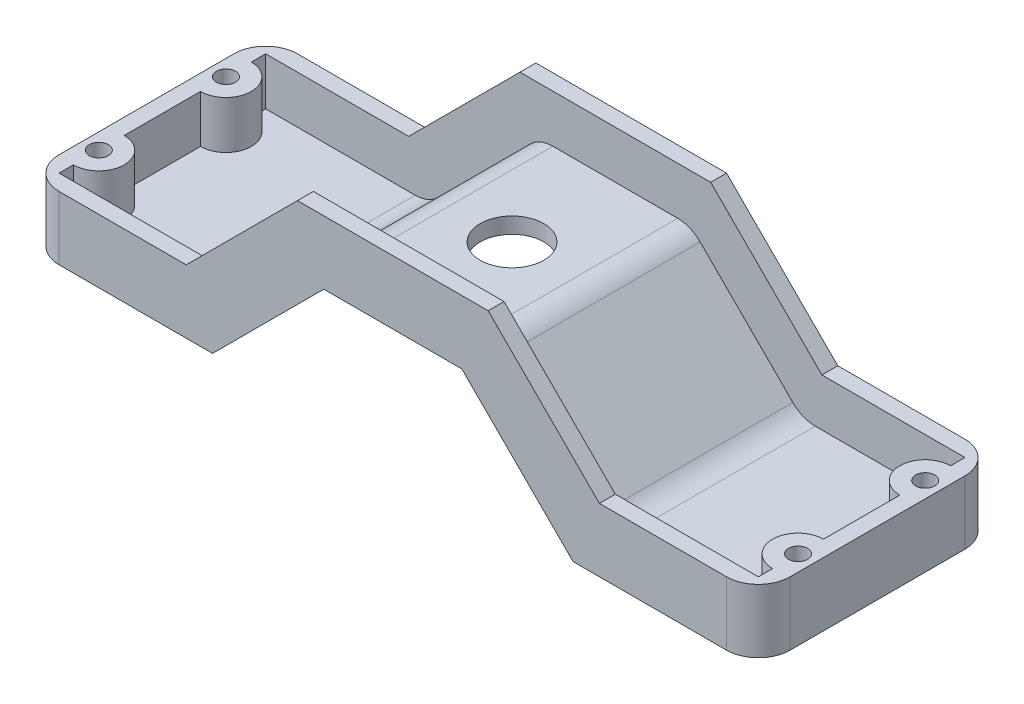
from build123d import *

# Parameters (mm, degrees)
EXTRUDE_THIN1_DEPTH     = 37.5
SHELL1_T                = -5
FILLET1_R               = 10
FILLET2_R               = 10
BOSS_EXTRUDE3_REACH     = 237.651
SKETCH5_R               = 3
CUT_EXTRUDE2_DEPTH      = 236.650694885
MIRROR3_COPY_1_REACH    = 237.651
MIRROR3_COPY_2_SKETCH_R = 3
MIRROR3_COPY_2_DEPTH    = 236.650694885
SKETCH7_R               = 10
CUT_EXTRUDE4_DEPTH      = 236.650694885


with BuildPart() as part:
    # Sketch1 → Extrude-Thin1 (new, symmetric)
    with BuildSketch(Plane.XY):
        Polygon((0, 0), (50, 0), (85, 35), (145, 35), (180, 0), (230, 0), (230, -20), (171.715728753, -20), (136.715728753, 15), (93.284271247, 15), (58.284271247, -20), (0, -20), align=None)
    extrude(amount=EXTRUDE_THIN1_DEPTH, both=True)

    # Shell1
    shell1_openings = [part.faces().sort_by_distance(p)[0] for p in [
        (25, 0, 0),
        (67.5, 17.5, 0),
        (115, 35, 0),
        (162.5, 17.5, 0),
        (205, 0, 0),
    ]]
    offset(amount=SHELL1_T, openings=shell1_openings, kind=Kind.INTERSECTION)

    # Fillet1
    fillet1_edges = [part.edges().sort_by_distance(p)[0] for p in [
        (0, -10, -37.5),
        (230, -10, -37.5),
        (0, -10, 37.5),
        (230, -10, 37.5),
    ]]
    fillet(fillet1_edges, radius=FILLET1_R)

    # Fillet2
    fillet2_edges = [part.edges().sort_by_distance(p)[0] for p in [
        (173.786796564, -15, 0),
        (56.213203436, -15, 0),
        (91.213203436, 20, 0),
        (138.786796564, 20, 0),
    ]]
    fillet(fillet2_edges, radius=FILLET2_R)

    # Sketch4 → Boss-Extrude3 (add, up to next)
    with BuildSketch(Plane(origin=(0, 0, 0), x_dir=(1, 0, 0), z_dir=(0, 1, 0)), mode=Mode.PRIVATE) as boss_extrude3_sk1:
        with BuildLine():
            Line((5, 28), (5, 12))
            ThreePointArc((5, 12), (13, 20), (5, 28))
        make_face()
    boss_extrude3_tool1 = extrude(boss_extrude3_sk1.sketch, amount=-BOSS_EXTRUDE3_REACH, mode=Mode.PRIVATE) - part.part
    boss_extrude3 = boss_extrude3_tool1.solids().sort_by_distance((8.395305, 0, -20))[0]
    add(boss_extrude3)

    # Sketch5 → Cut-Extrude2 (cut, through all)
    with BuildSketch(Plane(origin=(0, 0, 0), x_dir=(1, 0, 0), z_dir=(0, 1, 0))):
        with Locations(Location((5, 20, 0), (0, 0, 270))):
            Circle(SKETCH5_R)
    cut_extrude2 = extrude(amount=-CUT_EXTRUDE2_DEPTH, mode=Mode.SUBTRACT)

    # Mirror2: Boss-Extrude3, Cut-Extrude2 across plane
    add(boss_extrude3.mirror(Plane.XY))
    add(cut_extrude2.mirror(Plane.XY), mode=Mode.SUBTRACT)

    # Mirror3: Boss-Extrude3, Cut-Extrude2 across plane
    add(boss_extrude3.mirror(Plane.ZY.offset(-115)))
    add(cut_extrude2.mirror(Plane.ZY.offset(-115)), mode=Mode.SUBTRACT)

    # Mirror3 copy 1 sketch → Mirror3 copy 1 (add, up to next)
    with BuildSketch(Plane(origin=(230, 0, 0), x_dir=(-1, 0, 0), z_dir=(0, 1, 0)), mode=Mode.PRIVATE) as mirror3_copy_1_sk1:
        with BuildLine():
            Line((5, 28), (5, 12))
            ThreePointArc((5, 12), (13, 20), (5, 28))
        make_face()
    mirror3_copy_1_tool1 = extrude(mirror3_copy_1_sk1.sketch, amount=-MIRROR3_COPY_1_REACH, mode=Mode.PRIVATE) - part.part
    add(mirror3_copy_1_tool1.solids().sort_by_distance((221.604695, 0, 20))[0])

    # Mirror3 copy 2 sketch → Mirror3 copy 2 (cut, through all)
    with BuildSketch(Plane(origin=(230, 0, 0), x_dir=(-1, 0, 0), z_dir=(0, 1, 0))):
        with Locations(Location((5, 20, 0), (0, 0, 270))):
            Circle(MIRROR3_COPY_2_SKETCH_R)
    extrude(amount=-MIRROR3_COPY_2_DEPTH, mode=Mode.SUBTRACT)

    # Sketch7 → Cut-Extrude4 (cut, through all)
    with BuildSketch(Plane.XZ.offset(-15)):
        with Locations(Location((115, 0, 0), (0, 0, 270))):
            Circle(SKETCH7_R)
    extrude(amount=-CUT_EXTRUDE4_DEPTH, mode=Mode.SUBTRACT)


solid = part.part
